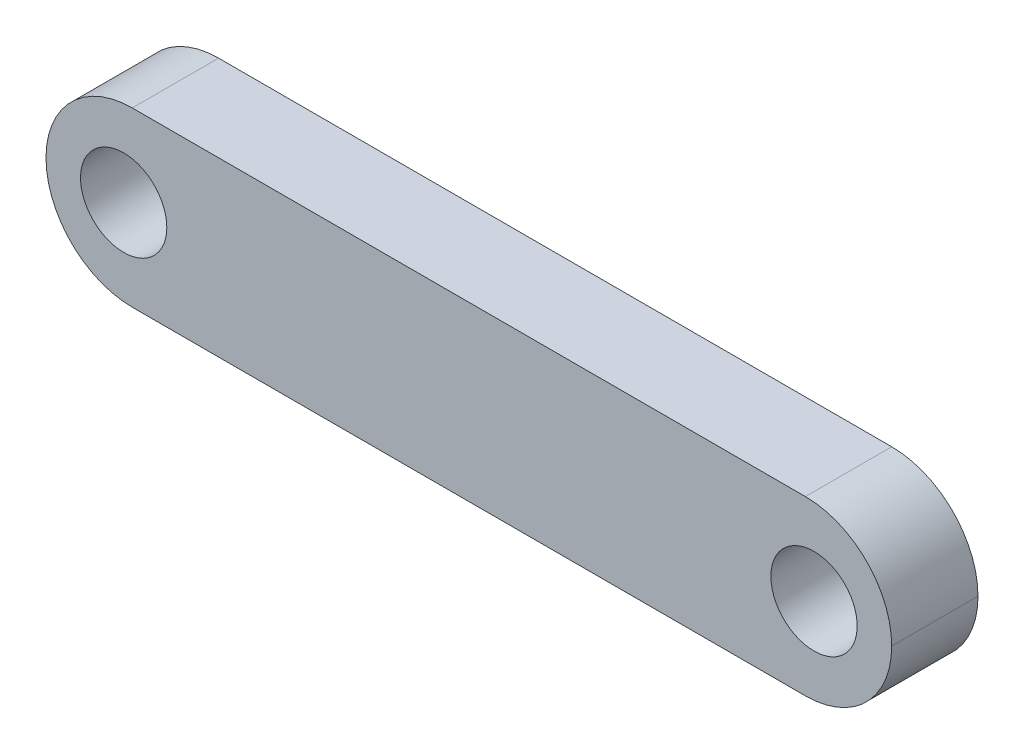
ISO-10303-21;
HEADER;
FILE_DESCRIPTION(('STEP AP214'),'2;1');
FILE_NAME('part.step','',(''),(''),'','','');
FILE_SCHEMA(('AUTOMOTIVE_DESIGN { 1 0 10303 214 1 1 1 1 }'));
ENDSEC;
DATA;
#1=APPLICATION_CONTEXT('core data for automotive mechanical design processes');
#2=APPLICATION_PROTOCOL_DEFINITION('international standard','automotive_design',2000,#1);
#3=PRODUCT_CONTEXT('',#1,'mechanical');
#4=PRODUCT('Part','Part','',(#3));
#5=PRODUCT_RELATED_PRODUCT_CATEGORY('part','',(#4));
#6=PRODUCT_DEFINITION_FORMATION('','',#4);
#7=PRODUCT_DEFINITION_CONTEXT('part definition',#1,'design');
#8=PRODUCT_DEFINITION('design','',#6,#7);
#9=PRODUCT_DEFINITION_SHAPE('','',#8);
#10=(LENGTH_UNIT() NAMED_UNIT(*) SI_UNIT(.MILLI.,.METRE.));
#11=(NAMED_UNIT(*) PLANE_ANGLE_UNIT() SI_UNIT($,.RADIAN.));
#12=(NAMED_UNIT(*) SI_UNIT($,.STERADIAN.) SOLID_ANGLE_UNIT());
#13=UNCERTAINTY_MEASURE_WITH_UNIT(LENGTH_MEASURE(1.E-05),#10,'distance_accuracy_value','');
#14=(GEOMETRIC_REPRESENTATION_CONTEXT(3) GLOBAL_UNCERTAINTY_ASSIGNED_CONTEXT((#13)) GLOBAL_UNIT_ASSIGNED_CONTEXT((#10,
#11,#12)) REPRESENTATION_CONTEXT('',''));
#15=CARTESIAN_POINT('',(0.,0.,0.));
#16=DIRECTION('',(0.,0.,1.));
#17=DIRECTION('',(1.,0.,0.));
#18=AXIS2_PLACEMENT_3D('',#15,#16,#17);
#19=CARTESIAN_POINT('',(0.,0.,5.));
#20=DIRECTION('',(0.,0.,1.));
#21=DIRECTION('',(1.,0.,0.));
#22=AXIS2_PLACEMENT_3D('',#19,#20,#21);
#23=PLANE('',#22);
#24=DIRECTION('',(1.,0.,0.));
#25=VECTOR('',#24,1.);
#26=CARTESIAN_POINT('',(24.5,-5.,5.));
#27=LINE('',#26,#25);
#28=CARTESIAN_POINT('',(-19.5,-5.,5.));
#29=VERTEX_POINT('',#28);
#30=CARTESIAN_POINT('',(19.5,-5.,5.));
#31=VERTEX_POINT('',#30);
#32=EDGE_CURVE('E133',#29,#31,#27,.T.);
#33=ORIENTED_EDGE('',*,*,#32,.T.);
#34=CARTESIAN_POINT('',(19.5,0.,5.));
#35=DIRECTION('',(0.,0.,1.));
#36=DIRECTION('',(1.,0.,0.));
#37=AXIS2_PLACEMENT_3D('',#34,#35,#36);
#38=CIRCLE('',#37,5.);
#39=CARTESIAN_POINT('',(24.5,0.,5.));
#40=VERTEX_POINT('',#39);
#41=EDGE_CURVE('E152',#31,#40,#38,.T.);
#42=ORIENTED_EDGE('',*,*,#41,.T.);
#43=CARTESIAN_POINT('',(19.5,0.,5.));
#44=DIRECTION('',(0.,0.,1.));
#45=DIRECTION('',(1.,0.,0.));
#46=AXIS2_PLACEMENT_3D('',#43,#44,#45);
#47=CIRCLE('',#46,5.);
#48=CARTESIAN_POINT('',(19.5,5.,5.));
#49=VERTEX_POINT('',#48);
#50=EDGE_CURVE('E64',#40,#49,#47,.T.);
#51=ORIENTED_EDGE('',*,*,#50,.T.);
#52=DIRECTION('',(-1.,0.,0.));
#53=VECTOR('',#52,1.);
#54=CARTESIAN_POINT('',(24.5,5.,5.));
#55=LINE('',#54,#53);
#56=CARTESIAN_POINT('',(-19.5,5.,5.));
#57=VERTEX_POINT('',#56);
#58=EDGE_CURVE('E112',#49,#57,#55,.T.);
#59=ORIENTED_EDGE('',*,*,#58,.T.);
#60=CARTESIAN_POINT('',(-19.5,0.,5.));
#61=DIRECTION('',(0.,0.,1.));
#62=DIRECTION('',(1.,0.,0.));
#63=AXIS2_PLACEMENT_3D('',#60,#61,#62);
#64=CIRCLE('',#63,5.);
#65=CARTESIAN_POINT('',(-24.5,0.,5.));
#66=VERTEX_POINT('',#65);
#67=EDGE_CURVE('E148',#57,#66,#64,.T.);
#68=ORIENTED_EDGE('',*,*,#67,.T.);
#69=CARTESIAN_POINT('',(-19.5,0.,5.));
#70=DIRECTION('',(0.,0.,1.));
#71=DIRECTION('',(1.,0.,0.));
#72=AXIS2_PLACEMENT_3D('',#69,#70,#71);
#73=CIRCLE('',#72,5.);
#74=EDGE_CURVE('E115',#66,#29,#73,.T.);
#75=ORIENTED_EDGE('',*,*,#74,.T.);
#76=EDGE_LOOP('',(#33,#42,#51,#59,#68,#75));
#77=FACE_BOUND('',#76,.T.);
#78=CARTESIAN_POINT('',(-20.,0.,5.));
#79=DIRECTION('',(0.,0.,1.));
#80=DIRECTION('',(1.,0.,0.));
#81=AXIS2_PLACEMENT_3D('',#78,#79,#80);
#82=CIRCLE('',#81,2.5);
#83=CARTESIAN_POINT('',(-17.5,0.,5.));
#84=VERTEX_POINT('',#83);
#85=EDGE_CURVE('E125',#84,#84,#82,.T.);
#86=ORIENTED_EDGE('',*,*,#85,.F.);
#87=EDGE_LOOP('',(#86));
#88=FACE_BOUND('',#87,.T.);
#89=CARTESIAN_POINT('',(20.,0.,5.));
#90=DIRECTION('',(0.,0.,-1.));
#91=DIRECTION('',(-1.,0.,0.));
#92=AXIS2_PLACEMENT_3D('',#89,#90,#91);
#93=CIRCLE('',#92,2.5);
#94=CARTESIAN_POINT('',(17.5,0.,5.));
#95=VERTEX_POINT('',#94);
#96=EDGE_CURVE('E120',#95,#95,#93,.T.);
#97=ORIENTED_EDGE('',*,*,#96,.T.);
#98=EDGE_LOOP('',(#97));
#99=FACE_BOUND('',#98,.T.);
#100=ADVANCED_FACE('F41',(#77,#88,#99),#23,.T.);
#101=CARTESIAN_POINT('',(0.,0.,0.));
#102=DIRECTION('',(0.,0.,1.));
#103=DIRECTION('',(1.,0.,0.));
#104=AXIS2_PLACEMENT_3D('',#101,#102,#103);
#105=PLANE('',#104);
#106=CARTESIAN_POINT('',(-20.,0.,0.));
#107=DIRECTION('',(0.,0.,1.));
#108=DIRECTION('',(1.,0.,0.));
#109=AXIS2_PLACEMENT_3D('',#106,#107,#108);
#110=CIRCLE('',#109,2.5);
#111=CARTESIAN_POINT('',(-17.5,0.,0.));
#112=VERTEX_POINT('',#111);
#113=EDGE_CURVE('E130',#112,#112,#110,.T.);
#114=ORIENTED_EDGE('',*,*,#113,.T.);
#115=EDGE_LOOP('',(#114));
#116=FACE_BOUND('',#115,.T.);
#117=CARTESIAN_POINT('',(19.5,0.,0.));
#118=DIRECTION('',(0.,0.,1.));
#119=DIRECTION('',(1.,0.,0.));
#120=AXIS2_PLACEMENT_3D('',#117,#118,#119);
#121=CIRCLE('',#120,5.);
#122=CARTESIAN_POINT('',(19.5,5.,0.));
#123=VERTEX_POINT('',#122);
#124=CARTESIAN_POINT('',(24.5,0.,0.));
#125=VERTEX_POINT('',#124);
#126=EDGE_CURVE('E106',#123,#125,#121,.F.);
#127=ORIENTED_EDGE('',*,*,#126,.T.);
#128=CARTESIAN_POINT('',(19.5,0.,0.));
#129=DIRECTION('',(0.,0.,1.));
#130=DIRECTION('',(1.,0.,0.));
#131=AXIS2_PLACEMENT_3D('',#128,#129,#130);
#132=CIRCLE('',#131,5.);
#133=CARTESIAN_POINT('',(19.5,-5.,0.));
#134=VERTEX_POINT('',#133);
#135=EDGE_CURVE('E141',#125,#134,#132,.F.);
#136=ORIENTED_EDGE('',*,*,#135,.T.);
#137=DIRECTION('',(1.,0.,0.));
#138=VECTOR('',#137,1.);
#139=CARTESIAN_POINT('',(24.5,-5.,0.));
#140=LINE('',#139,#138);
#141=CARTESIAN_POINT('',(-19.5,-5.,0.));
#142=VERTEX_POINT('',#141);
#143=EDGE_CURVE('E101',#142,#134,#140,.T.);
#144=ORIENTED_EDGE('',*,*,#143,.F.);
#145=CARTESIAN_POINT('',(-19.5,0.,0.));
#146=DIRECTION('',(0.,0.,1.));
#147=DIRECTION('',(1.,0.,0.));
#148=AXIS2_PLACEMENT_3D('',#145,#146,#147);
#149=CIRCLE('',#148,5.);
#150=CARTESIAN_POINT('',(-24.5,0.,0.));
#151=VERTEX_POINT('',#150);
#152=EDGE_CURVE('E94',#142,#151,#149,.F.);
#153=ORIENTED_EDGE('',*,*,#152,.T.);
#154=CARTESIAN_POINT('',(-19.5,0.,0.));
#155=DIRECTION('',(0.,0.,1.));
#156=DIRECTION('',(1.,0.,0.));
#157=AXIS2_PLACEMENT_3D('',#154,#155,#156);
#158=CIRCLE('',#157,5.);
#159=CARTESIAN_POINT('',(-19.5,5.,0.));
#160=VERTEX_POINT('',#159);
#161=EDGE_CURVE('E99',#151,#160,#158,.F.);
#162=ORIENTED_EDGE('',*,*,#161,.T.);
#163=DIRECTION('',(-1.,0.,0.));
#164=VECTOR('',#163,1.);
#165=CARTESIAN_POINT('',(24.5,5.,0.));
#166=LINE('',#165,#164);
#167=EDGE_CURVE('E136',#123,#160,#166,.T.);
#168=ORIENTED_EDGE('',*,*,#167,.F.);
#169=EDGE_LOOP('',(#127,#136,#144,#153,#162,#168));
#170=FACE_BOUND('',#169,.T.);
#171=CARTESIAN_POINT('',(20.,0.,0.));
#172=DIRECTION('',(0.,0.,-1.));
#173=DIRECTION('',(-1.,0.,0.));
#174=AXIS2_PLACEMENT_3D('',#171,#172,#173);
#175=CIRCLE('',#174,2.5);
#176=CARTESIAN_POINT('',(17.5,0.,0.));
#177=VERTEX_POINT('',#176);
#178=EDGE_CURVE('E117',#177,#177,#175,.T.);
#179=ORIENTED_EDGE('',*,*,#178,.F.);
#180=EDGE_LOOP('',(#179));
#181=FACE_BOUND('',#180,.T.);
#182=ADVANCED_FACE('F96',(#116,#170,#181),#105,.F.);
#183=CARTESIAN_POINT('',(24.5,-5.,5.));
#184=DIRECTION('',(0.,1.,0.));
#185=DIRECTION('',(-1.,0.,0.));
#186=AXIS2_PLACEMENT_3D('',#183,#184,#185);
#187=PLANE('',#186);
#188=ORIENTED_EDGE('',*,*,#143,.T.);
#189=DIRECTION('',(0.,0.,-1.));
#190=VECTOR('',#189,1.);
#191=CARTESIAN_POINT('',(19.5,-5.,5.));
#192=LINE('',#191,#190);
#193=EDGE_CURVE('E145',#134,#31,#192,.F.);
#194=ORIENTED_EDGE('',*,*,#193,.T.);
#195=ORIENTED_EDGE('',*,*,#32,.F.);
#196=DIRECTION('',(0.,0.,-1.));
#197=VECTOR('',#196,1.);
#198=CARTESIAN_POINT('',(-19.5,-5.,5.));
#199=LINE('',#198,#197);
#200=EDGE_CURVE('E143',#29,#142,#199,.T.);
#201=ORIENTED_EDGE('',*,*,#200,.T.);
#202=EDGE_LOOP('',(#188,#194,#195,#201));
#203=FACE_BOUND('',#202,.T.);
#204=ADVANCED_FACE('F166',(#203),#187,.F.);
#205=CARTESIAN_POINT('',(24.5,5.,5.));
#206=DIRECTION('',(0.,-1.,0.));
#207=DIRECTION('',(1.,0.,0.));
#208=AXIS2_PLACEMENT_3D('',#205,#206,#207);
#209=PLANE('',#208);
#210=ORIENTED_EDGE('',*,*,#58,.F.);
#211=DIRECTION('',(0.,0.,-1.));
#212=VECTOR('',#211,1.);
#213=CARTESIAN_POINT('',(19.5,5.,5.));
#214=LINE('',#213,#212);
#215=EDGE_CURVE('E11',#49,#123,#214,.T.);
#216=ORIENTED_EDGE('',*,*,#215,.T.);
#217=ORIENTED_EDGE('',*,*,#167,.T.);
#218=DIRECTION('',(0.,0.,-1.));
#219=VECTOR('',#218,1.);
#220=CARTESIAN_POINT('',(-19.5,5.,5.));
#221=LINE('',#220,#219);
#222=EDGE_CURVE('E50',#160,#57,#221,.F.);
#223=ORIENTED_EDGE('',*,*,#222,.T.);
#224=EDGE_LOOP('',(#210,#216,#217,#223));
#225=FACE_BOUND('',#224,.T.);
#226=ADVANCED_FACE('F168',(#225),#209,.F.);
#227=CARTESIAN_POINT('',(19.5,0.,5.));
#228=DIRECTION('',(0.,0.,-1.));
#229=DIRECTION('',(-1.,0.,0.));
#230=AXIS2_PLACEMENT_3D('',#227,#228,#229);
#231=CYLINDRICAL_SURFACE('',#230,5.);
#232=ORIENTED_EDGE('',*,*,#215,.F.);
#233=ORIENTED_EDGE('',*,*,#50,.F.);
#234=DIRECTION('',(0.,0.,-1.));
#235=VECTOR('',#234,1.);
#236=CARTESIAN_POINT('',(24.5,0.,5.));
#237=LINE('',#236,#235);
#238=EDGE_CURVE('E116',#125,#40,#237,.F.);
#239=ORIENTED_EDGE('',*,*,#238,.F.);
#240=ORIENTED_EDGE('',*,*,#126,.F.);
#241=EDGE_LOOP('',(#232,#233,#239,#240));
#242=FACE_BOUND('',#241,.T.);
#243=ADVANCED_FACE('F161',(#242),#231,.T.);
#244=CARTESIAN_POINT('',(19.5,0.,5.));
#245=DIRECTION('',(0.,0.,-1.));
#246=DIRECTION('',(-1.,0.,0.));
#247=AXIS2_PLACEMENT_3D('',#244,#245,#246);
#248=CYLINDRICAL_SURFACE('',#247,5.);
#249=ORIENTED_EDGE('',*,*,#41,.F.);
#250=ORIENTED_EDGE('',*,*,#193,.F.);
#251=ORIENTED_EDGE('',*,*,#135,.F.);
#252=ORIENTED_EDGE('',*,*,#238,.T.);
#253=EDGE_LOOP('',(#249,#250,#251,#252));
#254=FACE_BOUND('',#253,.T.);
#255=ADVANCED_FACE('F164',(#254),#248,.T.);
#256=CARTESIAN_POINT('',(-19.5,0.,5.));
#257=DIRECTION('',(0.,0.,-1.));
#258=DIRECTION('',(-1.,0.,0.));
#259=AXIS2_PLACEMENT_3D('',#256,#257,#258);
#260=CYLINDRICAL_SURFACE('',#259,5.);
#261=DIRECTION('',(0.,0.,-1.));
#262=VECTOR('',#261,1.);
#263=CARTESIAN_POINT('',(-24.5,0.,5.));
#264=LINE('',#263,#262);
#265=EDGE_CURVE('E45',#66,#151,#264,.T.);
#266=ORIENTED_EDGE('',*,*,#265,.F.);
#267=ORIENTED_EDGE('',*,*,#67,.F.);
#268=ORIENTED_EDGE('',*,*,#222,.F.);
#269=ORIENTED_EDGE('',*,*,#161,.F.);
#270=EDGE_LOOP('',(#266,#267,#268,#269));
#271=FACE_BOUND('',#270,.T.);
#272=ADVANCED_FACE('F43',(#271),#260,.T.);
#273=CARTESIAN_POINT('',(-19.5,0.,5.));
#274=DIRECTION('',(0.,0.,-1.));
#275=DIRECTION('',(-1.,0.,0.));
#276=AXIS2_PLACEMENT_3D('',#273,#274,#275);
#277=CYLINDRICAL_SURFACE('',#276,5.);
#278=ORIENTED_EDGE('',*,*,#74,.F.);
#279=ORIENTED_EDGE('',*,*,#265,.T.);
#280=ORIENTED_EDGE('',*,*,#152,.F.);
#281=ORIENTED_EDGE('',*,*,#200,.F.);
#282=EDGE_LOOP('',(#278,#279,#280,#281));
#283=FACE_BOUND('',#282,.T.);
#284=ADVANCED_FACE('F114',(#283),#277,.T.);
#285=CARTESIAN_POINT('',(-20.,0.,0.));
#286=DIRECTION('',(0.,0.,1.));
#287=DIRECTION('',(1.,0.,0.));
#288=AXIS2_PLACEMENT_3D('',#285,#286,#287);
#289=CYLINDRICAL_SURFACE('',#288,2.5);
#290=ORIENTED_EDGE('',*,*,#113,.F.);
#291=EDGE_LOOP('',(#290));
#292=FACE_BOUND('',#291,.T.);
#293=ORIENTED_EDGE('',*,*,#85,.T.);
#294=EDGE_LOOP('',(#293));
#295=FACE_BOUND('',#294,.T.);
#296=ADVANCED_FACE('F184',(#292,#295),#289,.F.);
#297=CARTESIAN_POINT('',(20.,0.,0.));
#298=DIRECTION('',(0.,0.,1.));
#299=DIRECTION('',(1.,0.,0.));
#300=AXIS2_PLACEMENT_3D('',#297,#298,#299);
#301=CYLINDRICAL_SURFACE('',#300,2.5);
#302=ORIENTED_EDGE('',*,*,#178,.T.);
#303=EDGE_LOOP('',(#302));
#304=FACE_BOUND('',#303,.T.);
#305=ORIENTED_EDGE('',*,*,#96,.F.);
#306=EDGE_LOOP('',(#305));
#307=FACE_BOUND('',#306,.T.);
#308=ADVANCED_FACE('F187',(#304,#307),#301,.F.);
#309=CLOSED_SHELL('',(#100,#182,#204,#226,#243,#255,#272,#284,#296,#308));
#310=MANIFOLD_SOLID_BREP('B2',#309);
#311=ADVANCED_BREP_SHAPE_REPRESENTATION('',(#18,#310),#14);
#312=SHAPE_DEFINITION_REPRESENTATION(#9,#311);
ENDSEC;
END-ISO-10303-21;
